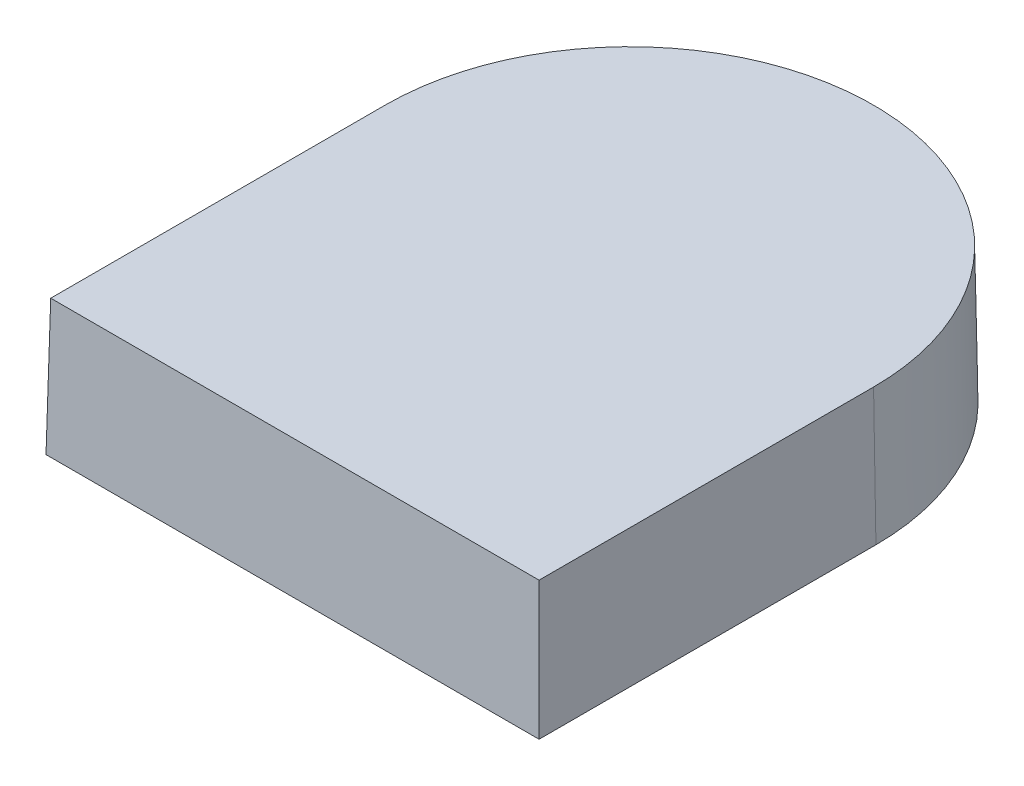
from build123d import *

# Parameters (mm, degrees)
DODANIE_WYCI_GNI_CIE1_DEPTH = 7.5
DODANIE_WYCI_GNI_CIE1_TAPER = 1


with BuildPart() as part:
    # Szkic2 → Dodanie-wyci_gni_cie1 (new body)
    with BuildSketch(Plane(origin=(0, 0, 0), x_dir=(1, 0, 0), z_dir=(0, 1, 0))):
        with BuildLine():
            ThreePointArc((13.65, 2.15), (0, 15.8), (-13.65, 2.15))
            Line((-13.65, 2.15), (-13.65, -16.5))
            Line((-13.65, -16.5), (13.65, -16.5))
            Line((13.65, -16.5), (13.65, 2.15))
        make_face()
    extrude(amount=DODANIE_WYCI_GNI_CIE1_DEPTH, taper=DODANIE_WYCI_GNI_CIE1_TAPER)


solid = part.part
